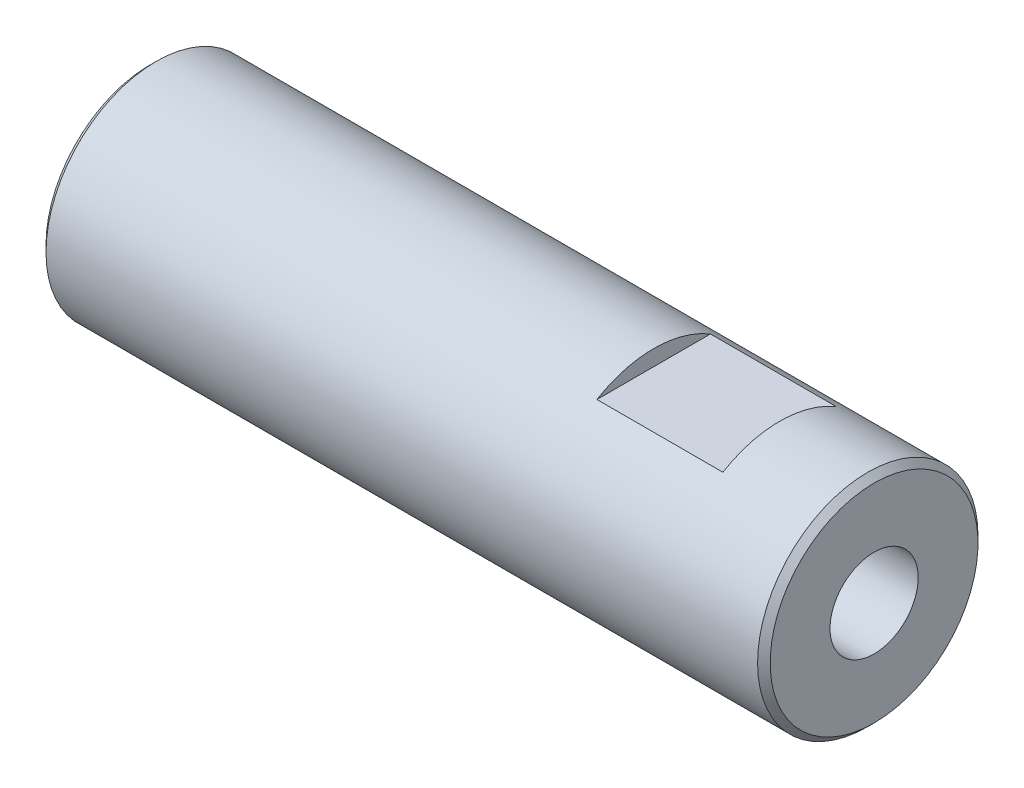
ISO-10303-21;
HEADER;
FILE_DESCRIPTION(('STEP AP214'),'2;1');
FILE_NAME('part.step','',(''),(''),'','','');
FILE_SCHEMA(('AUTOMOTIVE_DESIGN { 1 0 10303 214 1 1 1 1 }'));
ENDSEC;
DATA;
#1=APPLICATION_CONTEXT('core data for automotive mechanical design processes');
#2=APPLICATION_PROTOCOL_DEFINITION('international standard','automotive_design',2000,#1);
#3=PRODUCT_CONTEXT('',#1,'mechanical');
#4=PRODUCT('Part','Part','',(#3));
#5=PRODUCT_RELATED_PRODUCT_CATEGORY('part','',(#4));
#6=PRODUCT_DEFINITION_FORMATION('','',#4);
#7=PRODUCT_DEFINITION_CONTEXT('part definition',#1,'design');
#8=PRODUCT_DEFINITION('design','',#6,#7);
#9=PRODUCT_DEFINITION_SHAPE('','',#8);
#10=(LENGTH_UNIT() NAMED_UNIT(*) SI_UNIT(.MILLI.,.METRE.));
#11=(NAMED_UNIT(*) PLANE_ANGLE_UNIT() SI_UNIT($,.RADIAN.));
#12=(NAMED_UNIT(*) SI_UNIT($,.STERADIAN.) SOLID_ANGLE_UNIT());
#13=UNCERTAINTY_MEASURE_WITH_UNIT(LENGTH_MEASURE(1.E-05),#10,'distance_accuracy_value','');
#14=(GEOMETRIC_REPRESENTATION_CONTEXT(3) GLOBAL_UNCERTAINTY_ASSIGNED_CONTEXT((#13)) GLOBAL_UNIT_ASSIGNED_CONTEXT((#10,
#11,#12)) REPRESENTATION_CONTEXT('',''));
#15=CARTESIAN_POINT('',(0.,0.,0.));
#16=DIRECTION('',(0.,0.,1.));
#17=DIRECTION('',(1.,0.,0.));
#18=AXIS2_PLACEMENT_3D('',#15,#16,#17);
#19=CARTESIAN_POINT('',(72.9999999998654,0.,0.));
#20=DIRECTION('',(1.,0.,0.));
#21=DIRECTION('',(0.,0.,-1.));
#22=AXIS2_PLACEMENT_3D('',#19,#20,#21);
#23=CONICAL_SURFACE('',#22,6.99999999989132,1.02974425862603);
#24=CARTESIAN_POINT('',(68.7939756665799,0.,8.5265128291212E-11));
#25=VERTEX_POINT('',#24);
#26=VERTEX_LOOP('',#25);
#27=FACE_BOUND('',#26,.T.);
#28=CARTESIAN_POINT('',(73.,0.,0.));
#29=DIRECTION('',(1.,0.,0.));
#30=DIRECTION('',(0.,0.,-1.));
#31=AXIS2_PLACEMENT_3D('',#28,#29,#30);
#32=CIRCLE('',#31,6.99999999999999);
#33=CARTESIAN_POINT('',(73.,0.,-6.99999999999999));
#34=VERTEX_POINT('',#33);
#35=EDGE_CURVE('E94',#34,#34,#32,.T.);
#36=ORIENTED_EDGE('',*,*,#35,.T.);
#37=EDGE_LOOP('',(#36));
#38=FACE_BOUND('',#37,.T.);
#39=ADVANCED_FACE('F15',(#27,#38),#23,.F.);
#40=CARTESIAN_POINT('',(39.5,0.,0.));
#41=DIRECTION('',(-1.,0.,0.));
#42=DIRECTION('',(0.,0.,1.));
#43=AXIS2_PLACEMENT_3D('',#40,#41,#42);
#44=CONICAL_SURFACE('',#43,7.25,1.02974425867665);
#45=CARTESIAN_POINT('',(43.8562394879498,0.,0.));
#46=VERTEX_POINT('',#45);
#47=VERTEX_LOOP('',#46);
#48=FACE_BOUND('',#47,.T.);
#49=CARTESIAN_POINT('',(39.5,0.,0.));
#50=DIRECTION('',(-1.,0.,0.));
#51=DIRECTION('',(0.,0.,1.));
#52=AXIS2_PLACEMENT_3D('',#49,#50,#51);
#53=CIRCLE('',#52,7.25);
#54=CARTESIAN_POINT('',(39.5,0.,7.25));
#55=VERTEX_POINT('',#54);
#56=EDGE_CURVE('E90',#55,#55,#53,.T.);
#57=ORIENTED_EDGE('',*,*,#56,.T.);
#58=EDGE_LOOP('',(#57));
#59=FACE_BOUND('',#58,.T.);
#60=ADVANCED_FACE('F252',(#48,#59),#44,.F.);
#61=CARTESIAN_POINT('',(115.,0.,0.));
#62=DIRECTION('',(1.,0.,0.));
#63=DIRECTION('',(0.,0.,-1.));
#64=AXIS2_PLACEMENT_3D('',#61,#62,#63);
#65=CYLINDRICAL_SURFACE('',#64,6.99999999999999);
#66=ORIENTED_EDGE('',*,*,#35,.F.);
#67=EDGE_LOOP('',(#66));
#68=FACE_BOUND('',#67,.T.);
#69=CARTESIAN_POINT('',(115.,0.,0.));
#70=DIRECTION('',(1.,0.,0.));
#71=DIRECTION('',(0.,0.,-1.));
#72=AXIS2_PLACEMENT_3D('',#69,#70,#71);
#73=CIRCLE('',#72,6.99999999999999);
#74=CARTESIAN_POINT('',(115.,0.,-6.99999999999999));
#75=VERTEX_POINT('',#74);
#76=EDGE_CURVE('E18',#75,#75,#73,.T.);
#77=ORIENTED_EDGE('',*,*,#76,.T.);
#78=EDGE_LOOP('',(#77));
#79=FACE_BOUND('',#78,.T.);
#80=ADVANCED_FACE('F143',(#68,#79),#65,.F.);
#81=CARTESIAN_POINT('',(0.,0.,0.));
#82=DIRECTION('',(-1.,0.,0.));
#83=DIRECTION('',(0.,0.,1.));
#84=AXIS2_PLACEMENT_3D('',#81,#82,#83);
#85=CYLINDRICAL_SURFACE('',#84,7.25);
#86=ORIENTED_EDGE('',*,*,#56,.F.);
#87=EDGE_LOOP('',(#86));
#88=FACE_BOUND('',#87,.T.);
#89=CARTESIAN_POINT('',(0.,0.,0.));
#90=DIRECTION('',(-1.,0.,0.));
#91=DIRECTION('',(0.,0.,1.));
#92=AXIS2_PLACEMENT_3D('',#89,#90,#91);
#93=CIRCLE('',#92,7.25);
#94=CARTESIAN_POINT('',(0.,0.,7.25));
#95=VERTEX_POINT('',#94);
#96=EDGE_CURVE('E62',#95,#95,#93,.T.);
#97=ORIENTED_EDGE('',*,*,#96,.T.);
#98=EDGE_LOOP('',(#97));
#99=FACE_BOUND('',#98,.T.);
#100=ADVANCED_FACE('F133',(#88,#99),#85,.F.);
#101=CARTESIAN_POINT('',(115.,17.5,0.));
#102=DIRECTION('',(-1.,0.,0.));
#103=DIRECTION('',(0.,0.,1.));
#104=AXIS2_PLACEMENT_3D('',#101,#102,#103);
#105=PLANE('',#104);
#106=ORIENTED_EDGE('',*,*,#76,.F.);
#107=EDGE_LOOP('',(#106));
#108=FACE_BOUND('',#107,.T.);
#109=CARTESIAN_POINT('',(115.,0.,0.));
#110=DIRECTION('',(-1.,0.,0.));
#111=DIRECTION('',(0.,-1.,0.));
#112=AXIS2_PLACEMENT_3D('',#109,#110,#111);
#113=CIRCLE('',#112,16.5);
#114=CARTESIAN_POINT('',(115.,-16.5,0.));
#115=VERTEX_POINT('',#114);
#116=EDGE_CURVE('E83',#115,#115,#113,.T.);
#117=ORIENTED_EDGE('',*,*,#116,.F.);
#118=EDGE_LOOP('',(#117));
#119=FACE_BOUND('',#118,.T.);
#120=ADVANCED_FACE('F130',(#108,#119),#105,.F.);
#121=CARTESIAN_POINT('',(0.,17.5,0.));
#122=DIRECTION('',(1.,0.,0.));
#123=DIRECTION('',(0.,0.,-1.));
#124=AXIS2_PLACEMENT_3D('',#121,#122,#123);
#125=PLANE('',#124);
#126=ORIENTED_EDGE('',*,*,#96,.F.);
#127=EDGE_LOOP('',(#126));
#128=FACE_BOUND('',#127,.T.);
#129=CARTESIAN_POINT('',(0.,0.,0.));
#130=DIRECTION('',(1.,0.,0.));
#131=DIRECTION('',(0.,0.,-1.));
#132=AXIS2_PLACEMENT_3D('',#129,#130,#131);
#133=CIRCLE('',#132,16.5);
#134=CARTESIAN_POINT('',(0.,0.,-16.5));
#135=VERTEX_POINT('',#134);
#136=EDGE_CURVE('E76',#135,#135,#133,.T.);
#137=ORIENTED_EDGE('',*,*,#136,.F.);
#138=EDGE_LOOP('',(#137));
#139=FACE_BOUND('',#138,.T.);
#140=ADVANCED_FACE('F132',(#128,#139),#125,.F.);
#141=CARTESIAN_POINT('',(80.,-20.5210315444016,-25.));
#142=DIRECTION('',(-1.,0.,0.));
#143=DIRECTION('',(0.,0.,1.));
#144=AXIS2_PLACEMENT_3D('',#141,#142,#143);
#145=PLANE('',#144);
#146=CARTESIAN_POINT('',(80.,0.,0.));
#147=DIRECTION('',(-1.,0.,0.));
#148=DIRECTION('',(0.,0.,1.));
#149=AXIS2_PLACEMENT_3D('',#146,#147,#148);
#150=CIRCLE('',#149,17.5);
#151=CARTESIAN_POINT('',(80.,-15.,-9.01387818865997));
#152=VERTEX_POINT('',#151);
#153=CARTESIAN_POINT('',(80.,-15.,9.01387818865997));
#154=VERTEX_POINT('',#153);
#155=EDGE_CURVE('E59',#152,#154,#150,.T.);
#156=ORIENTED_EDGE('',*,*,#155,.F.);
#157=DIRECTION('',(0.,0.,1.));
#158=VECTOR('',#157,1.);
#159=CARTESIAN_POINT('',(80.,-15.,-25.));
#160=LINE('',#159,#158);
#161=EDGE_CURVE('E54',#152,#154,#160,.T.);
#162=ORIENTED_EDGE('',*,*,#161,.T.);
#163=EDGE_LOOP('',(#156,#162));
#164=FACE_BOUND('',#163,.T.);
#165=ADVANCED_FACE('F57',(#164),#145,.F.);
#166=CARTESIAN_POINT('',(80.,-15.,-25.));
#167=DIRECTION('',(0.,1.,0.));
#168=DIRECTION('',(0.,0.,1.));
#169=AXIS2_PLACEMENT_3D('',#166,#167,#168);
#170=PLANE('',#169);
#171=DIRECTION('',(-1.,0.,0.));
#172=VECTOR('',#171,1.);
#173=CARTESIAN_POINT('',(-14.6311083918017,-15.,9.01387818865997));
#174=LINE('',#173,#172);
#175=CARTESIAN_POINT('',(100.,-15.,9.01387818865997));
#176=VERTEX_POINT('',#175);
#177=EDGE_CURVE('E65',#154,#176,#174,.F.);
#178=ORIENTED_EDGE('',*,*,#177,.F.);
#179=ORIENTED_EDGE('',*,*,#161,.F.);
#180=DIRECTION('',(-1.,0.,0.));
#181=VECTOR('',#180,1.);
#182=CARTESIAN_POINT('',(-14.6311083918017,-15.,-9.01387818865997));
#183=LINE('',#182,#181);
#184=CARTESIAN_POINT('',(100.,-15.,-9.01387818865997));
#185=VERTEX_POINT('',#184);
#186=EDGE_CURVE('E74',#185,#152,#183,.T.);
#187=ORIENTED_EDGE('',*,*,#186,.F.);
#188=DIRECTION('',(0.,0.,-1.));
#189=VECTOR('',#188,1.);
#190=CARTESIAN_POINT('',(100.,-15.,-25.));
#191=LINE('',#190,#189);
#192=EDGE_CURVE('E61',#185,#176,#191,.F.);
#193=ORIENTED_EDGE('',*,*,#192,.T.);
#194=EDGE_LOOP('',(#178,#179,#187,#193));
#195=FACE_BOUND('',#194,.T.);
#196=ADVANCED_FACE('F66',(#195),#170,.F.);
#197=CARTESIAN_POINT('',(100.,-20.5210315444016,-25.));
#198=DIRECTION('',(1.,0.,0.));
#199=DIRECTION('',(0.,0.,-1.));
#200=AXIS2_PLACEMENT_3D('',#197,#198,#199);
#201=PLANE('',#200);
#202=CARTESIAN_POINT('',(100.,0.,0.));
#203=DIRECTION('',(-1.,0.,0.));
#204=DIRECTION('',(0.,0.,1.));
#205=AXIS2_PLACEMENT_3D('',#202,#203,#204);
#206=CIRCLE('',#205,17.5);
#207=EDGE_CURVE('E71',#176,#185,#206,.F.);
#208=ORIENTED_EDGE('',*,*,#207,.F.);
#209=ORIENTED_EDGE('',*,*,#192,.F.);
#210=EDGE_LOOP('',(#208,#209));
#211=FACE_BOUND('',#210,.T.);
#212=ADVANCED_FACE('F112',(#211),#201,.F.);
#213=CARTESIAN_POINT('',(100.,20.5210315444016,-25.));
#214=DIRECTION('',(1.,0.,0.));
#215=DIRECTION('',(0.,0.,-1.));
#216=AXIS2_PLACEMENT_3D('',#213,#214,#215);
#217=PLANE('',#216);
#218=CARTESIAN_POINT('',(100.,0.,0.));
#219=DIRECTION('',(-1.,0.,0.));
#220=DIRECTION('',(0.,0.,1.));
#221=AXIS2_PLACEMENT_3D('',#218,#219,#220);
#222=CIRCLE('',#221,17.5);
#223=CARTESIAN_POINT('',(100.,15.,-9.01387818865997));
#224=VERTEX_POINT('',#223);
#225=CARTESIAN_POINT('',(100.,15.,9.01387818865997));
#226=VERTEX_POINT('',#225);
#227=EDGE_CURVE('E105',#224,#226,#222,.F.);
#228=ORIENTED_EDGE('',*,*,#227,.F.);
#229=DIRECTION('',(0.,0.,-1.));
#230=VECTOR('',#229,1.);
#231=CARTESIAN_POINT('',(100.,15.,-25.));
#232=LINE('',#231,#230);
#233=EDGE_CURVE('E85',#224,#226,#232,.F.);
#234=ORIENTED_EDGE('',*,*,#233,.T.);
#235=EDGE_LOOP('',(#228,#234));
#236=FACE_BOUND('',#235,.T.);
#237=ADVANCED_FACE('F161',(#236),#217,.F.);
#238=CARTESIAN_POINT('',(80.,20.5210315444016,-25.));
#239=DIRECTION('',(-1.,0.,0.));
#240=DIRECTION('',(0.,0.,1.));
#241=AXIS2_PLACEMENT_3D('',#238,#239,#240);
#242=PLANE('',#241);
#243=CARTESIAN_POINT('',(80.,0.,0.));
#244=DIRECTION('',(-1.,0.,0.));
#245=DIRECTION('',(0.,0.,1.));
#246=AXIS2_PLACEMENT_3D('',#243,#244,#245);
#247=CIRCLE('',#246,17.5);
#248=CARTESIAN_POINT('',(80.,15.,9.01387818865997));
#249=VERTEX_POINT('',#248);
#250=CARTESIAN_POINT('',(80.,15.,-9.01387818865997));
#251=VERTEX_POINT('',#250);
#252=EDGE_CURVE('E101',#249,#251,#247,.T.);
#253=ORIENTED_EDGE('',*,*,#252,.F.);
#254=DIRECTION('',(0.,0.,-1.));
#255=VECTOR('',#254,1.);
#256=CARTESIAN_POINT('',(80.,15.,-25.));
#257=LINE('',#256,#255);
#258=EDGE_CURVE('E32',#249,#251,#257,.T.);
#259=ORIENTED_EDGE('',*,*,#258,.T.);
#260=EDGE_LOOP('',(#253,#259));
#261=FACE_BOUND('',#260,.T.);
#262=ADVANCED_FACE('F157',(#261),#242,.F.);
#263=CARTESIAN_POINT('',(80.,15.,-25.));
#264=DIRECTION('',(0.,-1.,0.));
#265=DIRECTION('',(0.,0.,-1.));
#266=AXIS2_PLACEMENT_3D('',#263,#264,#265);
#267=PLANE('',#266);
#268=DIRECTION('',(-1.,0.,0.));
#269=VECTOR('',#268,1.);
#270=CARTESIAN_POINT('',(-14.6311083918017,15.,-9.01387818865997));
#271=LINE('',#270,#269);
#272=EDGE_CURVE('E103',#251,#224,#271,.F.);
#273=ORIENTED_EDGE('',*,*,#272,.F.);
#274=ORIENTED_EDGE('',*,*,#258,.F.);
#275=DIRECTION('',(-1.,0.,0.));
#276=VECTOR('',#275,1.);
#277=CARTESIAN_POINT('',(-14.6311083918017,15.,9.01387818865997));
#278=LINE('',#277,#276);
#279=EDGE_CURVE('E104',#226,#249,#278,.T.);
#280=ORIENTED_EDGE('',*,*,#279,.F.);
#281=ORIENTED_EDGE('',*,*,#233,.F.);
#282=EDGE_LOOP('',(#273,#274,#280,#281));
#283=FACE_BOUND('',#282,.T.);
#284=ADVANCED_FACE('F126',(#283),#267,.F.);
#285=CARTESIAN_POINT('',(114.,0.,0.));
#286=DIRECTION('',(-1.,0.,0.));
#287=DIRECTION('',(0.,-1.,0.));
#288=AXIS2_PLACEMENT_3D('',#285,#286,#287);
#289=CONICAL_SURFACE('',#288,17.5,0.785398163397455);
#290=CARTESIAN_POINT('',(114.,0.,0.));
#291=DIRECTION('',(-1.,0.,0.));
#292=DIRECTION('',(0.,0.,1.));
#293=AXIS2_PLACEMENT_3D('',#290,#291,#292);
#294=CIRCLE('',#293,17.5);
#295=CARTESIAN_POINT('',(114.,0.,17.5));
#296=VERTEX_POINT('',#295);
#297=EDGE_CURVE('E24',#296,#296,#294,.T.);
#298=ORIENTED_EDGE('',*,*,#297,.F.);
#299=EDGE_LOOP('',(#298));
#300=FACE_BOUND('',#299,.T.);
#301=ORIENTED_EDGE('',*,*,#116,.T.);
#302=EDGE_LOOP('',(#301));
#303=FACE_BOUND('',#302,.T.);
#304=ADVANCED_FACE('F122',(#300,#303),#289,.T.);
#305=CARTESIAN_POINT('',(1.00000000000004,0.,0.));
#306=DIRECTION('',(1.,0.,0.));
#307=DIRECTION('',(0.,0.,-1.));
#308=AXIS2_PLACEMENT_3D('',#305,#306,#307);
#309=CONICAL_SURFACE('',#308,17.5,0.785398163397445);
#310=CARTESIAN_POINT('',(1.00000000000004,0.,0.));
#311=DIRECTION('',(-1.,0.,0.));
#312=DIRECTION('',(0.,0.,1.));
#313=AXIS2_PLACEMENT_3D('',#310,#311,#312);
#314=CIRCLE('',#313,17.5);
#315=CARTESIAN_POINT('',(1.00000000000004,0.,17.5));
#316=VERTEX_POINT('',#315);
#317=EDGE_CURVE('E10',#316,#316,#314,.F.);
#318=ORIENTED_EDGE('',*,*,#317,.F.);
#319=EDGE_LOOP('',(#318));
#320=FACE_BOUND('',#319,.T.);
#321=ORIENTED_EDGE('',*,*,#136,.T.);
#322=EDGE_LOOP('',(#321));
#323=FACE_BOUND('',#322,.T.);
#324=ADVANCED_FACE('F125',(#320,#323),#309,.T.);
#325=CARTESIAN_POINT('',(-14.6311083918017,0.,0.));
#326=DIRECTION('',(-1.,0.,0.));
#327=DIRECTION('',(0.,0.,1.));
#328=AXIS2_PLACEMENT_3D('',#325,#326,#327);
#329=CYLINDRICAL_SURFACE('',#328,17.5);
#330=ORIENTED_EDGE('',*,*,#317,.T.);
#331=EDGE_LOOP('',(#330));
#332=FACE_BOUND('',#331,.T.);
#333=ORIENTED_EDGE('',*,*,#297,.T.);
#334=EDGE_LOOP('',(#333));
#335=FACE_BOUND('',#334,.T.);
#336=ORIENTED_EDGE('',*,*,#252,.T.);
#337=ORIENTED_EDGE('',*,*,#272,.T.);
#338=ORIENTED_EDGE('',*,*,#227,.T.);
#339=ORIENTED_EDGE('',*,*,#279,.T.);
#340=EDGE_LOOP('',(#336,#337,#338,#339));
#341=FACE_BOUND('',#340,.T.);
#342=ORIENTED_EDGE('',*,*,#177,.T.);
#343=ORIENTED_EDGE('',*,*,#207,.T.);
#344=ORIENTED_EDGE('',*,*,#186,.T.);
#345=ORIENTED_EDGE('',*,*,#155,.T.);
#346=EDGE_LOOP('',(#342,#343,#344,#345));
#347=FACE_BOUND('',#346,.T.);
#348=ADVANCED_FACE('F73',(#332,#335,#341,#347),#329,.T.);
#349=CLOSED_SHELL('',(#39,#60,#80,#100,#120,#140,#165,#196,#212,#237,#262,#284,#304,#324,#348));
#350=MANIFOLD_SOLID_BREP('B1',#349);
#351=ADVANCED_BREP_SHAPE_REPRESENTATION('',(#18,#350),#14);
#352=SHAPE_DEFINITION_REPRESENTATION(#9,#351);
ENDSEC;
END-ISO-10303-21;
